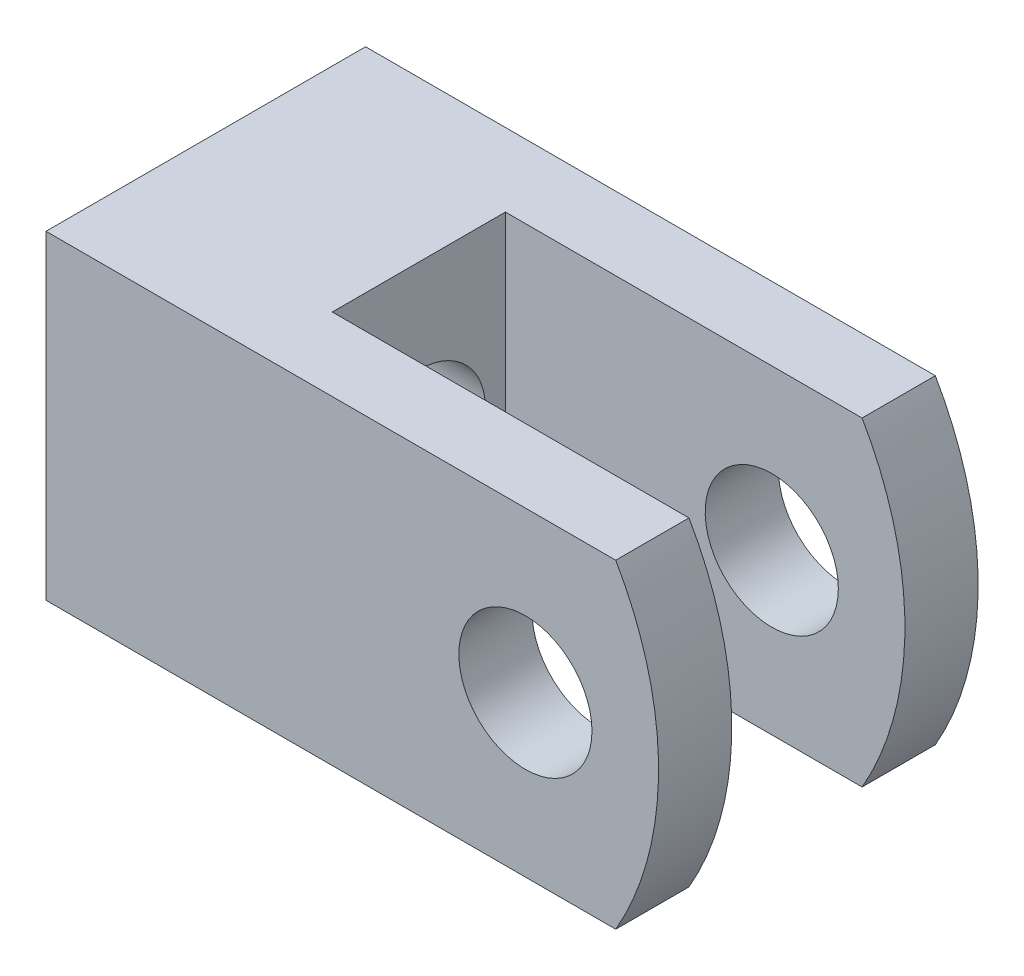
from build123d import *

# Parameters (mm, degrees)
BASE_EXTRUDE_DEPTH      = 6
CUT_EXTRUDE3_DEPTH      = 20.899748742
CUT_EXTRUDE3_DEPTH_BACK = 10
SKETCH5_W               = 6.5
SKETCH5_H               = 12
SKETCH7_R               = 2.5
CUT_EXTRUDE4_DEPTH      = 11
CHAMFER2_SIZE           = 0.2
CUT_EXTRUDE5_DEPTH      = 20.899748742
CUT_EXTRUDE5_DEPTH_BACK = 20.899748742
SKETCH6_R               = 2.5


with BuildPart() as part:
    # Sketch2 → Base-Extrude (new, symmetric)
    with BuildSketch(Plane.XY):
        with BuildLine():
            Line((-18, 6), (3.392304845, 6))
            ThreePointArc((3.392304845, 6), (5, 0), (3.392304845, -6))
            Line((3.392304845, -6), (-18, -6))
            Line((-18, -6), (-18, 6))
        make_face()
    extrude(amount=BASE_EXTRUDE_DEPTH, both=True)

    # Sketch5 → Cut-Extrude3 (cut, two sides: drawn at the far end of the back side and taken through both)
    with BuildSketch(Plane(origin=(0, 0, 0), x_dir=(0, 0, -1), z_dir=(1, 0, 0)).offset(-CUT_EXTRUDE3_DEPTH_BACK)):
        Rectangle(SKETCH5_W, SKETCH5_H)
    extrude(amount=CUT_EXTRUDE3_DEPTH + CUT_EXTRUDE3_DEPTH_BACK, mode=Mode.SUBTRACT)

    # Sketch7 → Cut-Extrude4 (cut)
    with BuildSketch(Plane.ZY.offset(18)):
        with Locations(Location((0, 0, 0), (0, 0, 180))):
            Circle(SKETCH7_R)
    extrude(amount=-CUT_EXTRUDE4_DEPTH, mode=Mode.SUBTRACT)

    # Chamfer2
    chamfer2_edges = [part.edges().sort_by_distance(p)[0] for p in [
        (-18, 0, 2.5),
    ]]
    chamfer(chamfer2_edges, length=CHAMFER2_SIZE)

    # Sketch6 → Cut-Extrude5 (cut, two sides: drawn at the far end of the back side and taken through both)
    with BuildSketch(Plane.XY.offset(-CUT_EXTRUDE5_DEPTH_BACK)):
        Circle(SKETCH6_R)
    extrude(amount=CUT_EXTRUDE5_DEPTH + CUT_EXTRUDE5_DEPTH_BACK, mode=Mode.SUBTRACT)


solid = part.part
